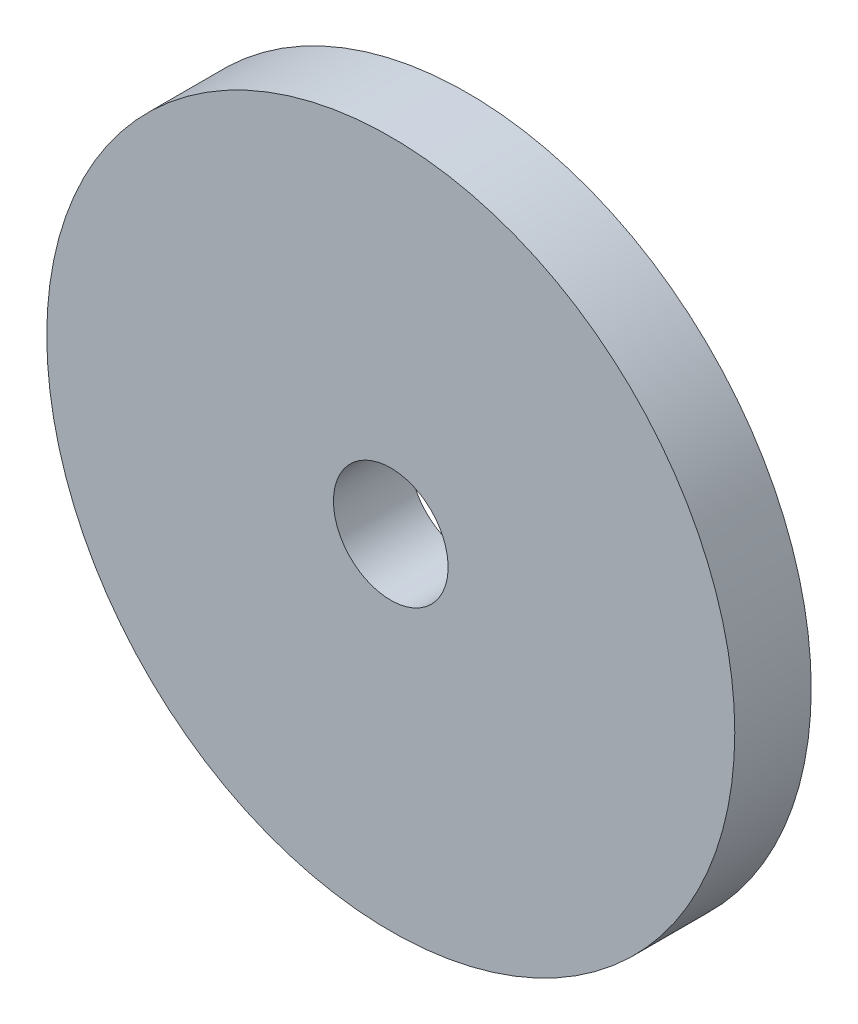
ISO-10303-21;
HEADER;
FILE_DESCRIPTION(('STEP AP214'),'2;1');
FILE_NAME('part.step','',(''),(''),'','','');
FILE_SCHEMA(('AUTOMOTIVE_DESIGN { 1 0 10303 214 1 1 1 1 }'));
ENDSEC;
DATA;
#1=APPLICATION_CONTEXT('core data for automotive mechanical design processes');
#2=APPLICATION_PROTOCOL_DEFINITION('international standard','automotive_design',2000,#1);
#3=PRODUCT_CONTEXT('',#1,'mechanical');
#4=PRODUCT('Part','Part','',(#3));
#5=PRODUCT_RELATED_PRODUCT_CATEGORY('part','',(#4));
#6=PRODUCT_DEFINITION_FORMATION('','',#4);
#7=PRODUCT_DEFINITION_CONTEXT('part definition',#1,'design');
#8=PRODUCT_DEFINITION('design','',#6,#7);
#9=PRODUCT_DEFINITION_SHAPE('','',#8);
#10=(LENGTH_UNIT() NAMED_UNIT(*) SI_UNIT(.MILLI.,.METRE.));
#11=(NAMED_UNIT(*) PLANE_ANGLE_UNIT() SI_UNIT($,.RADIAN.));
#12=(NAMED_UNIT(*) SI_UNIT($,.STERADIAN.) SOLID_ANGLE_UNIT());
#13=UNCERTAINTY_MEASURE_WITH_UNIT(LENGTH_MEASURE(1.E-05),#10,'distance_accuracy_value','');
#14=(GEOMETRIC_REPRESENTATION_CONTEXT(3) GLOBAL_UNCERTAINTY_ASSIGNED_CONTEXT((#13)) GLOBAL_UNIT_ASSIGNED_CONTEXT((#10,
#11,#12)) REPRESENTATION_CONTEXT('',''));
#15=CARTESIAN_POINT('',(0.,0.,0.));
#16=DIRECTION('',(0.,0.,1.));
#17=DIRECTION('',(1.,0.,0.));
#18=AXIS2_PLACEMENT_3D('',#15,#16,#17);
#19=CARTESIAN_POINT('',(0.,0.,4.));
#20=DIRECTION('',(0.,0.,-1.));
#21=DIRECTION('',(-1.,0.,0.));
#22=AXIS2_PLACEMENT_3D('',#19,#20,#21);
#23=CYLINDRICAL_SURFACE('',#22,18.);
#24=CARTESIAN_POINT('',(0.,0.,4.));
#25=DIRECTION('',(0.,0.,1.));
#26=DIRECTION('',(1.,0.,0.));
#27=AXIS2_PLACEMENT_3D('',#24,#25,#26);
#28=CIRCLE('',#27,18.);
#29=CARTESIAN_POINT('',(18.,0.,4.));
#30=VERTEX_POINT('',#29);
#31=EDGE_CURVE('E10',#30,#30,#28,.T.);
#32=ORIENTED_EDGE('',*,*,#31,.F.);
#33=EDGE_LOOP('',(#32));
#34=FACE_BOUND('',#33,.T.);
#35=CARTESIAN_POINT('',(0.,0.,0.));
#36=DIRECTION('',(0.,0.,1.));
#37=DIRECTION('',(1.,0.,0.));
#38=AXIS2_PLACEMENT_3D('',#35,#36,#37);
#39=CIRCLE('',#38,18.);
#40=CARTESIAN_POINT('',(18.,0.,0.));
#41=VERTEX_POINT('',#40);
#42=EDGE_CURVE('E34',#41,#41,#39,.T.);
#43=ORIENTED_EDGE('',*,*,#42,.T.);
#44=EDGE_LOOP('',(#43));
#45=FACE_BOUND('',#44,.T.);
#46=ADVANCED_FACE('F31',(#34,#45),#23,.T.);
#47=CARTESIAN_POINT('',(0.,0.,4.));
#48=DIRECTION('',(0.,0.,1.));
#49=DIRECTION('',(1.,0.,0.));
#50=AXIS2_PLACEMENT_3D('',#47,#48,#49);
#51=PLANE('',#50);
#52=CARTESIAN_POINT('',(0.,0.,4.));
#53=DIRECTION('',(0.,0.,-1.));
#54=DIRECTION('',(-1.,0.,0.));
#55=AXIS2_PLACEMENT_3D('',#52,#53,#54);
#56=CIRCLE('',#55,3.);
#57=CARTESIAN_POINT('',(-3.,0.,4.));
#58=VERTEX_POINT('',#57);
#59=EDGE_CURVE('E41',#58,#58,#56,.T.);
#60=ORIENTED_EDGE('',*,*,#59,.T.);
#61=EDGE_LOOP('',(#60));
#62=FACE_BOUND('',#61,.T.);
#63=ORIENTED_EDGE('',*,*,#31,.T.);
#64=EDGE_LOOP('',(#63));
#65=FACE_BOUND('',#64,.T.);
#66=ADVANCED_FACE('F49',(#62,#65),#51,.T.);
#67=CARTESIAN_POINT('',(0.,0.,0.));
#68=DIRECTION('',(0.,0.,1.));
#69=DIRECTION('',(1.,0.,0.));
#70=AXIS2_PLACEMENT_3D('',#67,#68,#69);
#71=PLANE('',#70);
#72=CARTESIAN_POINT('',(0.,0.,0.));
#73=DIRECTION('',(0.,0.,-1.));
#74=DIRECTION('',(-1.,0.,0.));
#75=AXIS2_PLACEMENT_3D('',#72,#73,#74);
#76=CIRCLE('',#75,3.);
#77=CARTESIAN_POINT('',(-3.,0.,0.));
#78=VERTEX_POINT('',#77);
#79=EDGE_CURVE('E43',#78,#78,#76,.T.);
#80=ORIENTED_EDGE('',*,*,#79,.F.);
#81=EDGE_LOOP('',(#80));
#82=FACE_BOUND('',#81,.T.);
#83=ORIENTED_EDGE('',*,*,#42,.F.);
#84=EDGE_LOOP('',(#83));
#85=FACE_BOUND('',#84,.T.);
#86=ADVANCED_FACE('F54',(#82,#85),#71,.F.);
#87=CARTESIAN_POINT('',(0.,0.,4.));
#88=DIRECTION('',(0.,0.,-1.));
#89=DIRECTION('',(-1.,0.,0.));
#90=AXIS2_PLACEMENT_3D('',#87,#88,#89);
#91=CYLINDRICAL_SURFACE('',#90,3.);
#92=ORIENTED_EDGE('',*,*,#59,.F.);
#93=EDGE_LOOP('',(#92));
#94=FACE_BOUND('',#93,.T.);
#95=ORIENTED_EDGE('',*,*,#79,.T.);
#96=EDGE_LOOP('',(#95));
#97=FACE_BOUND('',#96,.T.);
#98=ADVANCED_FACE('F51',(#94,#97),#91,.F.);
#99=CLOSED_SHELL('',(#46,#66,#86,#98));
#100=MANIFOLD_SOLID_BREP('B2',#99);
#101=ADVANCED_BREP_SHAPE_REPRESENTATION('',(#18,#100),#14);
#102=SHAPE_DEFINITION_REPRESENTATION(#9,#101);
ENDSEC;
END-ISO-10303-21;
